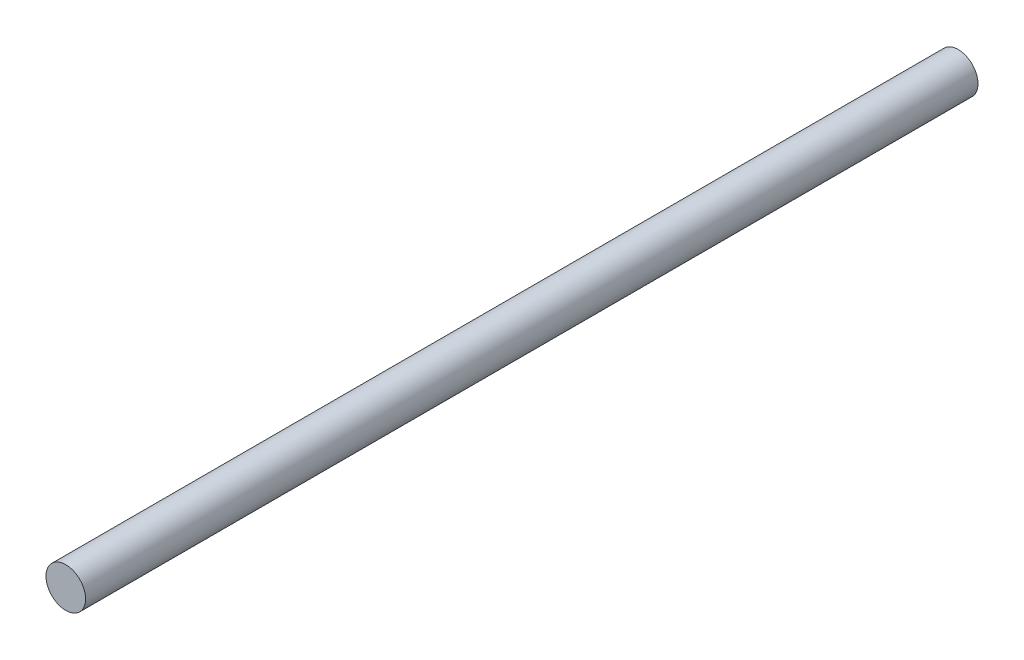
ISO-10303-21;
HEADER;
FILE_DESCRIPTION(('STEP AP214'),'2;1');
FILE_NAME('part.step','',(''),(''),'','','');
FILE_SCHEMA(('AUTOMOTIVE_DESIGN { 1 0 10303 214 1 1 1 1 }'));
ENDSEC;
DATA;
#1=APPLICATION_CONTEXT('core data for automotive mechanical design processes');
#2=APPLICATION_PROTOCOL_DEFINITION('international standard','automotive_design',2000,#1);
#3=PRODUCT_CONTEXT('',#1,'mechanical');
#4=PRODUCT('Part','Part','',(#3));
#5=PRODUCT_RELATED_PRODUCT_CATEGORY('part','',(#4));
#6=PRODUCT_DEFINITION_FORMATION('','',#4);
#7=PRODUCT_DEFINITION_CONTEXT('part definition',#1,'design');
#8=PRODUCT_DEFINITION('design','',#6,#7);
#9=PRODUCT_DEFINITION_SHAPE('','',#8);
#10=(LENGTH_UNIT() NAMED_UNIT(*) SI_UNIT(.MILLI.,.METRE.));
#11=(NAMED_UNIT(*) PLANE_ANGLE_UNIT() SI_UNIT($,.RADIAN.));
#12=(NAMED_UNIT(*) SI_UNIT($,.STERADIAN.) SOLID_ANGLE_UNIT());
#13=UNCERTAINTY_MEASURE_WITH_UNIT(LENGTH_MEASURE(1.E-05),#10,'distance_accuracy_value','');
#14=(GEOMETRIC_REPRESENTATION_CONTEXT(3) GLOBAL_UNCERTAINTY_ASSIGNED_CONTEXT((#13)) GLOBAL_UNIT_ASSIGNED_CONTEXT((#10,
#11,#12)) REPRESENTATION_CONTEXT('',''));
#15=CARTESIAN_POINT('',(0.,0.,0.));
#16=DIRECTION('',(0.,0.,1.));
#17=DIRECTION('',(1.,0.,0.));
#18=AXIS2_PLACEMENT_3D('',#15,#16,#17);
#19=CARTESIAN_POINT('',(0.,0.,-1350.));
#20=DIRECTION('',(0.,0.,1.));
#21=DIRECTION('',(1.,0.,0.));
#22=AXIS2_PLACEMENT_3D('',#19,#20,#21);
#23=CYLINDRICAL_SURFACE('',#22,30.);
#24=CARTESIAN_POINT('',(0.,0.,-1350.));
#25=DIRECTION('',(0.,0.,1.));
#26=DIRECTION('',(1.,0.,0.));
#27=AXIS2_PLACEMENT_3D('',#24,#25,#26);
#28=CIRCLE('',#27,30.);
#29=CARTESIAN_POINT('',(30.,0.,-1350.));
#30=VERTEX_POINT('',#29);
#31=EDGE_CURVE('E10',#30,#30,#28,.T.);
#32=ORIENTED_EDGE('',*,*,#31,.T.);
#33=EDGE_LOOP('',(#32));
#34=FACE_BOUND('',#33,.T.);
#35=CARTESIAN_POINT('',(0.,0.,0.));
#36=DIRECTION('',(0.,0.,1.));
#37=DIRECTION('',(1.,0.,0.));
#38=AXIS2_PLACEMENT_3D('',#35,#36,#37);
#39=CIRCLE('',#38,30.);
#40=CARTESIAN_POINT('',(30.,0.,0.));
#41=VERTEX_POINT('',#40);
#42=EDGE_CURVE('E40',#41,#41,#39,.T.);
#43=ORIENTED_EDGE('',*,*,#42,.F.);
#44=EDGE_LOOP('',(#43));
#45=FACE_BOUND('',#44,.T.);
#46=ADVANCED_FACE('F37',(#34,#45),#23,.T.);
#47=CARTESIAN_POINT('',(0.,0.,-1350.));
#48=DIRECTION('',(0.,0.,1.));
#49=DIRECTION('',(1.,0.,0.));
#50=AXIS2_PLACEMENT_3D('',#47,#48,#49);
#51=PLANE('',#50);
#52=ORIENTED_EDGE('',*,*,#31,.F.);
#53=EDGE_LOOP('',(#52));
#54=FACE_BOUND('',#53,.T.);
#55=ADVANCED_FACE('F54',(#54),#51,.F.);
#56=CARTESIAN_POINT('',(0.,0.,0.));
#57=DIRECTION('',(0.,0.,1.));
#58=DIRECTION('',(1.,0.,0.));
#59=AXIS2_PLACEMENT_3D('',#56,#57,#58);
#60=PLANE('',#59);
#61=ORIENTED_EDGE('',*,*,#42,.T.);
#62=EDGE_LOOP('',(#61));
#63=FACE_BOUND('',#62,.T.);
#64=ADVANCED_FACE('F51',(#63),#60,.T.);
#65=CLOSED_SHELL('',(#46,#55,#64));
#66=MANIFOLD_SOLID_BREP('B2',#65);
#67=ADVANCED_BREP_SHAPE_REPRESENTATION('',(#18,#66),#14);
#68=SHAPE_DEFINITION_REPRESENTATION(#9,#67);
ENDSEC;
END-ISO-10303-21;
